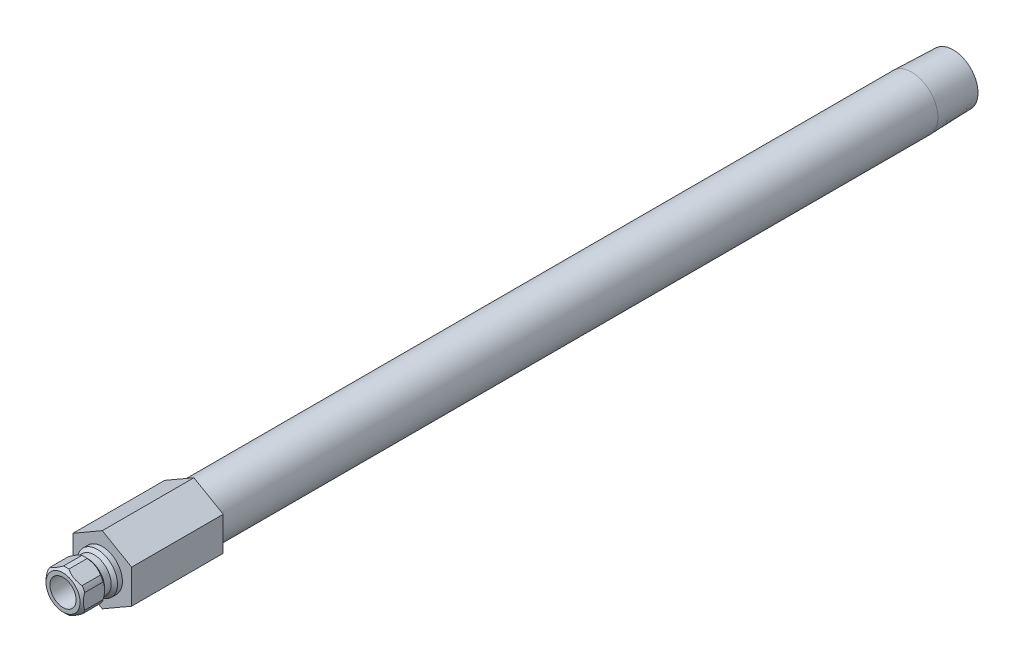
ISO-10303-21;
HEADER;
FILE_DESCRIPTION(('STEP AP214'),'2;1');
FILE_NAME('part.step','',(''),(''),'','','');
FILE_SCHEMA(('AUTOMOTIVE_DESIGN { 1 0 10303 214 1 1 1 1 }'));
ENDSEC;
DATA;
#1=APPLICATION_CONTEXT('core data for automotive mechanical design processes');
#2=APPLICATION_PROTOCOL_DEFINITION('international standard','automotive_design',2000,#1);
#3=PRODUCT_CONTEXT('',#1,'mechanical');
#4=PRODUCT('Part','Part','',(#3));
#5=PRODUCT_RELATED_PRODUCT_CATEGORY('part','',(#4));
#6=PRODUCT_DEFINITION_FORMATION('','',#4);
#7=PRODUCT_DEFINITION_CONTEXT('part definition',#1,'design');
#8=PRODUCT_DEFINITION('design','',#6,#7);
#9=PRODUCT_DEFINITION_SHAPE('','',#8);
#10=(LENGTH_UNIT() NAMED_UNIT(*) SI_UNIT(.MILLI.,.METRE.));
#11=(NAMED_UNIT(*) PLANE_ANGLE_UNIT() SI_UNIT($,.RADIAN.));
#12=(NAMED_UNIT(*) SI_UNIT($,.STERADIAN.) SOLID_ANGLE_UNIT());
#13=UNCERTAINTY_MEASURE_WITH_UNIT(LENGTH_MEASURE(1.E-05),#10,'distance_accuracy_value','');
#14=(GEOMETRIC_REPRESENTATION_CONTEXT(3) GLOBAL_UNCERTAINTY_ASSIGNED_CONTEXT((#13)) GLOBAL_UNIT_ASSIGNED_CONTEXT((#10,
#11,#12)) REPRESENTATION_CONTEXT('',''));
#15=CARTESIAN_POINT('',(0.,0.,0.));
#16=DIRECTION('',(0.,0.,1.));
#17=DIRECTION('',(1.,0.,0.));
#18=AXIS2_PLACEMENT_3D('',#15,#16,#17);
#19=CARTESIAN_POINT('',(0.,0.,0.));
#20=DIRECTION('',(0.,0.,-1.));
#21=DIRECTION('',(0.,1.,0.));
#22=AXIS2_PLACEMENT_3D('',#19,#20,#21);
#23=CYLINDRICAL_SURFACE('',#22,4.8895);
#24=DIRECTION('',(0.,0.,-1.));
#25=VECTOR('',#24,1.);
#26=CARTESIAN_POINT('',(3.87288738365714,-2.98461950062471,0.));
#27=LINE('',#26,#25);
#28=CARTESIAN_POINT('',(3.87288738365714,-2.98461950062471,4.318));
#29=VERTEX_POINT('',#28);
#30=CARTESIAN_POINT('',(3.87288738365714,-2.98461950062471,8.76299999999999));
#31=VERTEX_POINT('',#30);
#32=EDGE_CURVE('E392',#29,#31,#27,.F.);
#33=ORIENTED_EDGE('',*,*,#32,.F.);
#34=CARTESIAN_POINT('',(0.,0.,4.318));
#35=DIRECTION('',(0.,0.,-1.));
#36=DIRECTION('',(0.,1.,0.));
#37=AXIS2_PLACEMENT_3D('',#34,#35,#36);
#38=CIRCLE('',#37,4.8895);
#39=CARTESIAN_POINT('',(4.5212,-1.86170910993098,4.318));
#40=VERTEX_POINT('',#39);
#41=EDGE_CURVE('E369',#40,#29,#38,.T.);
#42=ORIENTED_EDGE('',*,*,#41,.F.);
#43=DIRECTION('',(0.,0.,-1.));
#44=VECTOR('',#43,1.);
#45=CARTESIAN_POINT('',(4.5212,-1.86170910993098,0.));
#46=LINE('',#45,#44);
#47=CARTESIAN_POINT('',(4.5212,-1.86170910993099,8.76299999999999));
#48=VERTEX_POINT('',#47);
#49=EDGE_CURVE('E383',#48,#40,#46,.T.);
#50=ORIENTED_EDGE('',*,*,#49,.F.);
#51=CARTESIAN_POINT('',(0.,0.,8.76299999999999));
#52=DIRECTION('',(0.,0.,-1.));
#53=DIRECTION('',(0.,1.,0.));
#54=AXIS2_PLACEMENT_3D('',#51,#52,#53);
#55=CIRCLE('',#54,4.8895);
#56=EDGE_CURVE('E191',#48,#31,#55,.T.);
#57=ORIENTED_EDGE('',*,*,#56,.T.);
#58=EDGE_LOOP('',(#33,#42,#50,#57));
#59=FACE_BOUND('',#58,.T.);
#60=ADVANCED_FACE('F34',(#59),#23,.T.);
#61=DIRECTION('',(0.,0.,-1.));
#62=VECTOR('',#61,1.);
#63=CARTESIAN_POINT('',(4.5212,1.86170910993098,0.));
#64=LINE('',#63,#62);
#65=CARTESIAN_POINT('',(4.5212,1.86170910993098,4.318));
#66=VERTEX_POINT('',#65);
#67=CARTESIAN_POINT('',(4.5212,1.86170910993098,8.76299999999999));
#68=VERTEX_POINT('',#67);
#69=EDGE_CURVE('E295',#66,#68,#64,.F.);
#70=ORIENTED_EDGE('',*,*,#69,.F.);
#71=CARTESIAN_POINT('',(3.87288738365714,2.98461950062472,4.318));
#72=VERTEX_POINT('',#71);
#73=EDGE_CURVE('E204',#72,#66,#38,.T.);
#74=ORIENTED_EDGE('',*,*,#73,.F.);
#75=DIRECTION('',(0.,0.,-1.));
#76=VECTOR('',#75,1.);
#77=CARTESIAN_POINT('',(3.87288738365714,2.98461950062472,0.));
#78=LINE('',#77,#76);
#79=CARTESIAN_POINT('',(3.87288738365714,2.98461950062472,8.76299999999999));
#80=VERTEX_POINT('',#79);
#81=EDGE_CURVE('E380',#80,#72,#78,.T.);
#82=ORIENTED_EDGE('',*,*,#81,.F.);
#83=EDGE_CURVE('E198',#80,#68,#55,.T.);
#84=ORIENTED_EDGE('',*,*,#83,.T.);
#85=EDGE_LOOP('',(#70,#74,#82,#84));
#86=FACE_BOUND('',#85,.T.);
#87=ADVANCED_FACE('F329',(#86),#23,.T.);
#88=DIRECTION('',(0.,0.,-1.));
#89=VECTOR('',#88,1.);
#90=CARTESIAN_POINT('',(0.648312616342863,4.84632861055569,0.));
#91=LINE('',#90,#89);
#92=CARTESIAN_POINT('',(0.648312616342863,4.84632861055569,4.318));
#93=VERTEX_POINT('',#92);
#94=CARTESIAN_POINT('',(0.648312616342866,4.84632861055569,8.76299999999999));
#95=VERTEX_POINT('',#94);
#96=EDGE_CURVE('E385',#93,#95,#91,.F.);
#97=ORIENTED_EDGE('',*,*,#96,.F.);
#98=CARTESIAN_POINT('',(-0.648312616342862,4.84632861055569,4.318));
#99=VERTEX_POINT('',#98);
#100=EDGE_CURVE('E200',#99,#93,#38,.T.);
#101=ORIENTED_EDGE('',*,*,#100,.F.);
#102=DIRECTION('',(0.,0.,-1.));
#103=VECTOR('',#102,1.);
#104=CARTESIAN_POINT('',(-0.648312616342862,4.84632861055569,0.));
#105=LINE('',#104,#103);
#106=CARTESIAN_POINT('',(-0.648312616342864,4.84632861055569,8.76299999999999));
#107=VERTEX_POINT('',#106);
#108=EDGE_CURVE('E361',#107,#99,#105,.T.);
#109=ORIENTED_EDGE('',*,*,#108,.F.);
#110=EDGE_CURVE('E193',#107,#95,#55,.T.);
#111=ORIENTED_EDGE('',*,*,#110,.T.);
#112=EDGE_LOOP('',(#97,#101,#109,#111));
#113=FACE_BOUND('',#112,.T.);
#114=ADVANCED_FACE('F334',(#113),#23,.T.);
#115=DIRECTION('',(0.,0.,-1.));
#116=VECTOR('',#115,1.);
#117=CARTESIAN_POINT('',(-3.87288738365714,2.98461950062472,0.));
#118=LINE('',#117,#116);
#119=CARTESIAN_POINT('',(-3.87288738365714,2.98461950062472,4.318));
#120=VERTEX_POINT('',#119);
#121=CARTESIAN_POINT('',(-3.87288738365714,2.98461950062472,8.76299999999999));
#122=VERTEX_POINT('',#121);
#123=EDGE_CURVE('E54',#120,#122,#118,.F.);
#124=ORIENTED_EDGE('',*,*,#123,.F.);
#125=CARTESIAN_POINT('',(-4.5212,1.86170910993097,4.318));
#126=VERTEX_POINT('',#125);
#127=EDGE_CURVE('E203',#126,#120,#38,.T.);
#128=ORIENTED_EDGE('',*,*,#127,.F.);
#129=DIRECTION('',(0.,0.,-1.));
#130=VECTOR('',#129,1.);
#131=CARTESIAN_POINT('',(-4.5212,1.86170910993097,0.));
#132=LINE('',#131,#130);
#133=CARTESIAN_POINT('',(-4.5212,1.86170910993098,8.763));
#134=VERTEX_POINT('',#133);
#135=EDGE_CURVE('E249',#134,#126,#132,.T.);
#136=ORIENTED_EDGE('',*,*,#135,.F.);
#137=EDGE_CURVE('E189',#134,#122,#55,.T.);
#138=ORIENTED_EDGE('',*,*,#137,.T.);
#139=EDGE_LOOP('',(#124,#128,#136,#138));
#140=FACE_BOUND('',#139,.T.);
#141=ADVANCED_FACE('F346',(#140),#23,.T.);
#142=DIRECTION('',(0.,0.,-1.));
#143=VECTOR('',#142,1.);
#144=CARTESIAN_POINT('',(-4.5212,-1.86170910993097,0.));
#145=LINE('',#144,#143);
#146=CARTESIAN_POINT('',(-4.5212,-1.86170910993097,4.318));
#147=VERTEX_POINT('',#146);
#148=CARTESIAN_POINT('',(-4.5212,-1.86170910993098,8.76299999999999));
#149=VERTEX_POINT('',#148);
#150=EDGE_CURVE('E62',#147,#149,#145,.F.);
#151=ORIENTED_EDGE('',*,*,#150,.F.);
#152=CARTESIAN_POINT('',(-3.87288738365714,-2.98461950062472,4.318));
#153=VERTEX_POINT('',#152);
#154=EDGE_CURVE('E182',#153,#147,#38,.T.);
#155=ORIENTED_EDGE('',*,*,#154,.F.);
#156=DIRECTION('',(0.,0.,-1.));
#157=VECTOR('',#156,1.);
#158=CARTESIAN_POINT('',(-3.87288738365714,-2.98461950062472,0.));
#159=LINE('',#158,#157);
#160=CARTESIAN_POINT('',(-3.87288738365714,-2.98461950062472,8.76299999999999));
#161=VERTEX_POINT('',#160);
#162=EDGE_CURVE('E165',#161,#153,#159,.T.);
#163=ORIENTED_EDGE('',*,*,#162,.F.);
#164=EDGE_CURVE('E180',#161,#149,#55,.T.);
#165=ORIENTED_EDGE('',*,*,#164,.T.);
#166=EDGE_LOOP('',(#151,#155,#163,#165));
#167=FACE_BOUND('',#166,.T.);
#168=ADVANCED_FACE('F179',(#167),#23,.T.);
#169=CARTESIAN_POINT('',(0.,0.,0.));
#170=DIRECTION('',(0.,0.,-1.));
#171=DIRECTION('',(0.,1.,0.));
#172=AXIS2_PLACEMENT_3D('',#169,#170,#171);
#173=CYLINDRICAL_SURFACE('',#172,6.34999999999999);
#174=CARTESIAN_POINT('',(0.,0.,-196.342));
#175=DIRECTION('',(0.,0.,-1.));
#176=DIRECTION('',(0.,1.,0.));
#177=AXIS2_PLACEMENT_3D('',#174,#175,#176);
#178=CIRCLE('',#177,6.34999999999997);
#179=CARTESIAN_POINT('',(0.,6.35,-196.342));
#180=VERTEX_POINT('',#179);
#181=EDGE_CURVE('E217',#180,#180,#178,.T.);
#182=ORIENTED_EDGE('',*,*,#181,.F.);
#183=EDGE_LOOP('',(#182));
#184=FACE_BOUND('',#183,.T.);
#185=CARTESIAN_POINT('',(0.,0.,-22.225));
#186=DIRECTION('',(0.,0.,1.));
#187=DIRECTION('',(1.,0.,0.));
#188=AXIS2_PLACEMENT_3D('',#185,#186,#187);
#189=CIRCLE('',#188,6.34999999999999);
#190=CARTESIAN_POINT('',(6.34999999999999,0.,-22.225));
#191=VERTEX_POINT('',#190);
#192=EDGE_CURVE('E438',#191,#191,#189,.F.);
#193=ORIENTED_EDGE('',*,*,#192,.T.);
#194=EDGE_LOOP('',(#193));
#195=FACE_BOUND('',#194,.T.);
#196=ADVANCED_FACE('F345',(#184,#195),#173,.T.);
#197=CARTESIAN_POINT('',(0.,6.03647060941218,-206.375));
#198=DIRECTION('',(0.,0.,-1.));
#199=DIRECTION('',(0.,1.,0.));
#200=AXIS2_PLACEMENT_3D('',#197,#198,#199);
#201=PLANE('',#200);
#202=CARTESIAN_POINT('',(0.,0.,-206.375));
#203=DIRECTION('',(0.,0.,-1.));
#204=DIRECTION('',(0.,1.,0.));
#205=AXIS2_PLACEMENT_3D('',#202,#203,#204);
#206=CIRCLE('',#205,6.03647060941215);
#207=CARTESIAN_POINT('',(0.,6.03647060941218,-206.375));
#208=VERTEX_POINT('',#207);
#209=EDGE_CURVE('E174',#208,#208,#206,.T.);
#210=ORIENTED_EDGE('',*,*,#209,.T.);
#211=EDGE_LOOP('',(#210));
#212=FACE_BOUND('',#211,.T.);
#213=CARTESIAN_POINT('',(0.,0.,-206.375));
#214=DIRECTION('',(0.,0.,-1.));
#215=DIRECTION('',(0.,1.,0.));
#216=AXIS2_PLACEMENT_3D('',#213,#214,#215);
#217=CIRCLE('',#216,4.62279999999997);
#218=CARTESIAN_POINT('',(0.,4.6228,-206.375));
#219=VERTEX_POINT('',#218);
#220=EDGE_CURVE('E450',#219,#219,#217,.T.);
#221=ORIENTED_EDGE('',*,*,#220,.F.);
#222=EDGE_LOOP('',(#221));
#223=FACE_BOUND('',#222,.T.);
#224=ADVANCED_FACE('F36',(#212,#223),#201,.T.);
#225=CARTESIAN_POINT('',(0.,0.,-206.375));
#226=DIRECTION('',(0.,0.,1.));
#227=DIRECTION('',(0.,-1.,0.));
#228=AXIS2_PLACEMENT_3D('',#225,#226,#227);
#229=CONICAL_SURFACE('',#228,6.03647060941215,0.0312396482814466);
#230=ORIENTED_EDGE('',*,*,#181,.T.);
#231=EDGE_LOOP('',(#230));
#232=FACE_BOUND('',#231,.T.);
#233=ORIENTED_EDGE('',*,*,#209,.F.);
#234=EDGE_LOOP('',(#233));
#235=FACE_BOUND('',#234,.T.);
#236=ADVANCED_FACE('F526',(#232,#235),#229,.T.);
#237=CARTESIAN_POINT('',(0.,4.8895,0.));
#238=DIRECTION('',(0.,0.,1.));
#239=DIRECTION('',(0.,-1.,0.));
#240=AXIS2_PLACEMENT_3D('',#237,#238,#239);
#241=PLANE('',#240);
#242=CARTESIAN_POINT('',(0.,0.,0.));
#243=DIRECTION('',(0.,0.,-1.));
#244=DIRECTION('',(0.,1.,0.));
#245=AXIS2_PLACEMENT_3D('',#242,#243,#244);
#246=CIRCLE('',#245,4.8895);
#247=CARTESIAN_POINT('',(0.,4.8895,0.));
#248=VERTEX_POINT('',#247);
#249=EDGE_CURVE('E214',#248,#248,#246,.T.);
#250=ORIENTED_EDGE('',*,*,#249,.T.);
#251=EDGE_LOOP('',(#250));
#252=FACE_BOUND('',#251,.T.);
#253=DIRECTION('',(-0.866025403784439,-0.5,0.));
#254=VECTOR('',#253,1.);
#255=CARTESIAN_POINT('',(0.,8.21223022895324,0.));
#256=LINE('',#255,#254);
#257=CARTESIAN_POINT('',(0.,8.21223022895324,0.));
#258=VERTEX_POINT('',#257);
#259=CARTESIAN_POINT('',(-7.112,4.10611511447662,0.));
#260=VERTEX_POINT('',#259);
#261=EDGE_CURVE('E395',#258,#260,#256,.T.);
#262=ORIENTED_EDGE('',*,*,#261,.T.);
#263=DIRECTION('',(0.,-1.,0.));
#264=VECTOR('',#263,1.);
#265=CARTESIAN_POINT('',(-7.112,4.10611511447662,0.));
#266=LINE('',#265,#264);
#267=CARTESIAN_POINT('',(-7.112,-4.10611511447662,0.));
#268=VERTEX_POINT('',#267);
#269=EDGE_CURVE('E422',#260,#268,#266,.T.);
#270=ORIENTED_EDGE('',*,*,#269,.T.);
#271=DIRECTION('',(0.866025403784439,-0.5,0.));
#272=VECTOR('',#271,1.);
#273=CARTESIAN_POINT('',(-7.112,-4.10611511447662,0.));
#274=LINE('',#273,#272);
#275=CARTESIAN_POINT('',(0.,-8.21223022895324,0.));
#276=VERTEX_POINT('',#275);
#277=EDGE_CURVE('E425',#268,#276,#274,.T.);
#278=ORIENTED_EDGE('',*,*,#277,.T.);
#279=DIRECTION('',(0.866025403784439,0.5,0.));
#280=VECTOR('',#279,1.);
#281=CARTESIAN_POINT('',(0.,-8.21223022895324,0.));
#282=LINE('',#281,#280);
#283=CARTESIAN_POINT('',(7.112,-4.10611511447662,0.));
#284=VERTEX_POINT('',#283);
#285=EDGE_CURVE('E428',#276,#284,#282,.T.);
#286=ORIENTED_EDGE('',*,*,#285,.T.);
#287=DIRECTION('',(0.,1.,0.));
#288=VECTOR('',#287,1.);
#289=CARTESIAN_POINT('',(7.112,-4.10611511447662,0.));
#290=LINE('',#289,#288);
#291=CARTESIAN_POINT('',(7.112,4.10611511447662,0.));
#292=VERTEX_POINT('',#291);
#293=EDGE_CURVE('E431',#284,#292,#290,.T.);
#294=ORIENTED_EDGE('',*,*,#293,.T.);
#295=DIRECTION('',(-0.866025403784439,0.5,0.));
#296=VECTOR('',#295,1.);
#297=CARTESIAN_POINT('',(7.112,4.10611511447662,0.));
#298=LINE('',#297,#296);
#299=EDGE_CURVE('E404',#292,#258,#298,.T.);
#300=ORIENTED_EDGE('',*,*,#299,.T.);
#301=EDGE_LOOP('',(#262,#270,#278,#286,#294,#300));
#302=FACE_BOUND('',#301,.T.);
#303=ADVANCED_FACE('F523',(#252,#302),#241,.T.);
#304=CARTESIAN_POINT('',(0.,0.,0.));
#305=DIRECTION('',(0.,0.,-1.));
#306=DIRECTION('',(0.,1.,0.));
#307=AXIS2_PLACEMENT_3D('',#304,#305,#306);
#308=CYLINDRICAL_SURFACE('',#307,4.8895);
#309=CARTESIAN_POINT('',(0.,0.,1.2065));
#310=DIRECTION('',(0.,0.,-1.));
#311=DIRECTION('',(0.,1.,0.));
#312=AXIS2_PLACEMENT_3D('',#309,#310,#311);
#313=CIRCLE('',#312,4.8895);
#314=CARTESIAN_POINT('',(0.,4.8895,1.2065));
#315=VERTEX_POINT('',#314);
#316=EDGE_CURVE('E211',#315,#315,#313,.T.);
#317=ORIENTED_EDGE('',*,*,#316,.T.);
#318=EDGE_LOOP('',(#317));
#319=FACE_BOUND('',#318,.T.);
#320=ORIENTED_EDGE('',*,*,#249,.F.);
#321=EDGE_LOOP('',(#320));
#322=FACE_BOUND('',#321,.T.);
#323=ADVANCED_FACE('F525',(#319,#322),#308,.T.);
#324=CARTESIAN_POINT('',(0.,0.,1.2065));
#325=DIRECTION('',(0.,0.,-1.));
#326=DIRECTION('',(0.,1.,0.));
#327=AXIS2_PLACEMENT_3D('',#324,#325,#326);
#328=CONICAL_SURFACE('',#327,4.8895,0.785398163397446);
#329=CARTESIAN_POINT('',(0.,0.,1.9685));
#330=DIRECTION('',(0.,0.,-1.));
#331=DIRECTION('',(0.,1.,0.));
#332=AXIS2_PLACEMENT_3D('',#329,#330,#331);
#333=CIRCLE('',#332,4.1275);
#334=CARTESIAN_POINT('',(0.,4.1275,1.9685));
#335=VERTEX_POINT('',#334);
#336=EDGE_CURVE('E208',#335,#335,#333,.T.);
#337=ORIENTED_EDGE('',*,*,#336,.T.);
#338=EDGE_LOOP('',(#337));
#339=FACE_BOUND('',#338,.T.);
#340=ORIENTED_EDGE('',*,*,#316,.F.);
#341=EDGE_LOOP('',(#340));
#342=FACE_BOUND('',#341,.T.);
#343=ADVANCED_FACE('F533',(#339,#342),#328,.T.);
#344=CARTESIAN_POINT('',(0.,0.,0.));
#345=DIRECTION('',(0.,0.,-1.));
#346=DIRECTION('',(0.,1.,0.));
#347=AXIS2_PLACEMENT_3D('',#344,#345,#346);
#348=CYLINDRICAL_SURFACE('',#347,4.1275);
#349=CARTESIAN_POINT('',(0.,0.,3.556));
#350=DIRECTION('',(0.,0.,-1.));
#351=DIRECTION('',(0.,1.,0.));
#352=AXIS2_PLACEMENT_3D('',#349,#350,#351);
#353=CIRCLE('',#352,4.1275);
#354=CARTESIAN_POINT('',(0.,4.1275,3.556));
#355=VERTEX_POINT('',#354);
#356=EDGE_CURVE('E205',#355,#355,#353,.T.);
#357=ORIENTED_EDGE('',*,*,#356,.T.);
#358=EDGE_LOOP('',(#357));
#359=FACE_BOUND('',#358,.T.);
#360=ORIENTED_EDGE('',*,*,#336,.F.);
#361=EDGE_LOOP('',(#360));
#362=FACE_BOUND('',#361,.T.);
#363=ADVANCED_FACE('F256',(#359,#362),#348,.T.);
#364=CARTESIAN_POINT('',(0.,0.,3.556));
#365=DIRECTION('',(0.,0.,1.));
#366=DIRECTION('',(0.,-1.,0.));
#367=AXIS2_PLACEMENT_3D('',#364,#365,#366);
#368=CONICAL_SURFACE('',#367,4.1275,0.785398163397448);
#369=CARTESIAN_POINT('',(0.64785777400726,-4.84659121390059,4.3182));
#370=CARTESIAN_POINT('',(0.775261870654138,-4.77303442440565,4.26213711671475));
#371=CARTESIAN_POINT('',(0.904457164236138,-4.69844348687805,4.21102627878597));
#372=CARTESIAN_POINT('',(1.16629518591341,-4.5472712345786,4.12074318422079));
#373=CARTESIAN_POINT('',(1.2989462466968,-4.47068510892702,4.08160338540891));
#374=CARTESIAN_POINT('',(1.56203676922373,-4.31878972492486,4.01877592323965));
#375=CARTESIAN_POINT('',(1.69238331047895,-4.24353411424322,3.99458163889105));
#376=CARTESIAN_POINT('',(1.95434729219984,-4.09228913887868,3.96102228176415));
#377=CARTESIAN_POINT('',(2.0859628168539,-4.01630088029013,3.951637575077));
#378=CARTESIAN_POINT('',(2.35623055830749,-3.86026172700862,3.9482192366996));
#379=CARTESIAN_POINT('',(2.49489129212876,-3.78020591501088,3.95501290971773));
#380=CARTESIAN_POINT('',(2.77103341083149,-3.62077518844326,3.98518499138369));
#381=CARTESIAN_POINT('',(2.90851272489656,-3.54140146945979,4.00858815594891));
#382=CARTESIAN_POINT('',(3.18622016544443,-3.38106700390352,4.07155129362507));
#383=CARTESIAN_POINT('',(3.32634361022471,-3.30016669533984,4.11171074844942));
#384=CARTESIAN_POINT('',(3.60275664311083,-3.14057955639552,4.20550294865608));
#385=CARTESIAN_POINT('',(3.73905611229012,-3.06188702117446,4.25909654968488));
#386=CARTESIAN_POINT('',(3.87334222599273,-2.98435689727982,4.3182));
#387=B_SPLINE_CURVE_WITH_KNOTS('',3,(#369,#370,#371,#372,#373,#374,#375,#376,#377,#378,#379,
#380,#381,#382,#383,#384,#385,#386),.UNSPECIFIED.,.F.,.F.,(4,2,2,2,2,2,2,2,4),(0.,
0.472469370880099,0.946208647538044,1.40285320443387,1.85889185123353,2.33874707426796,
2.81931901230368,3.31879975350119,3.81684169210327),.UNSPECIFIED.);
#388=CARTESIAN_POINT('',(0.648312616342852,-4.84632861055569,4.318));
#389=VERTEX_POINT('',#388);
#390=EDGE_CURVE('E394',#389,#29,#387,.T.);
#391=ORIENTED_EDGE('',*,*,#390,.F.);
#392=CARTESIAN_POINT('',(-0.648312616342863,-4.84632861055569,4.318));
#393=VERTEX_POINT('',#392);
#394=EDGE_CURVE('E367',#389,#393,#38,.T.);
#395=ORIENTED_EDGE('',*,*,#394,.T.);
#396=CARTESIAN_POINT('',(-3.87334222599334,-2.98435689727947,4.31820000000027));
#397=CARTESIAN_POINT('',(-3.74593812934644,-3.05791368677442,4.26213711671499));
#398=CARTESIAN_POINT('',(-3.61674283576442,-3.13250462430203,4.21102627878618));
#399=CARTESIAN_POINT('',(-3.35490481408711,-3.28367687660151,4.12074318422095));
#400=CARTESIAN_POINT('',(-3.22225375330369,-3.3602630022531,4.08160338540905));
#401=CARTESIAN_POINT('',(-2.95916323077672,-3.51215838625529,4.01877592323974));
#402=CARTESIAN_POINT('',(-2.82881668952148,-3.58741399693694,3.99458163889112));
#403=CARTESIAN_POINT('',(-2.56685270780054,-3.73865897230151,3.96102228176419));
#404=CARTESIAN_POINT('',(-2.43523718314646,-3.81464723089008,3.95163757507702));
#405=CARTESIAN_POINT('',(-2.16496944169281,-3.97068638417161,3.94821923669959));
#406=CARTESIAN_POINT('',(-2.02630870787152,-4.05074219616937,3.95501290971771));
#407=CARTESIAN_POINT('',(-1.75016658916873,-4.21017292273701,3.98518499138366));
#408=CARTESIAN_POINT('',(-1.61268727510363,-4.28954664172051,4.00858815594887));
#409=CARTESIAN_POINT('',(-1.33497983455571,-4.44988110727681,4.07155129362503));
#410=CARTESIAN_POINT('',(-1.1948563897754,-4.5307814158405,4.11171074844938));
#411=CARTESIAN_POINT('',(-0.918443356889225,-4.69036855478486,4.20550294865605));
#412=CARTESIAN_POINT('',(-0.782143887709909,-4.76906109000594,4.25909654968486));
#413=CARTESIAN_POINT('',(-0.647857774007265,-4.84659121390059,4.3182));
#414=B_SPLINE_CURVE_WITH_KNOTS('',3,(#396,#397,#398,#399,#400,#401,#402,#403,#404,#405,#406,
#407,#408,#409,#410,#411,#412,#413),.UNSPECIFIED.,.F.,.F.,(4,2,2,2,2,2,2,2,4),(0.,
0.472469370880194,0.946208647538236,1.40285320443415,1.85889185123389,2.33874707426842,
2.81931901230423,3.31879975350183,3.81684169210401),.UNSPECIFIED.);
#415=EDGE_CURVE('E242',#153,#393,#414,.T.);
#416=ORIENTED_EDGE('',*,*,#415,.F.);
#417=ORIENTED_EDGE('',*,*,#154,.T.);
#418=CARTESIAN_POINT('',(-4.5212,-5.15925306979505,6.2884665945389));
#419=CARTESIAN_POINT('',(-4.5212,-5.03341781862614,6.19384981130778));
#420=CARTESIAN_POINT('',(-4.5212,-4.90687282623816,6.10016148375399));
#421=CARTESIAN_POINT('',(-4.5212,-4.65208542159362,5.91505573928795));
#422=CARTESIAN_POINT('',(-4.5212,-4.52384258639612,5.82363890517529));
#423=CARTESIAN_POINT('',(-4.5212,-4.26444371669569,5.64284060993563));
#424=CARTESIAN_POINT('',(-4.5212,-4.13327280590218,5.55348041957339));
#425=CARTESIAN_POINT('',(-4.5212,-3.86869655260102,5.37814219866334));
#426=CARTESIAN_POINT('',(-4.5212,-3.735291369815,5.29216392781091));
#427=CARTESIAN_POINT('',(-4.5212,-3.45835736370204,5.1196421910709));
#428=CARTESIAN_POINT('',(-4.5212,-3.31467977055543,5.03333631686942));
#429=CARTESIAN_POINT('',(-4.5212,-3.02397608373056,4.86646929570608));
#430=CARTESIAN_POINT('',(-4.5212,-2.87694947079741,4.78590904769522));
#431=CARTESIAN_POINT('',(-4.5212,-2.57957206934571,4.6322757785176));
#432=CARTESIAN_POINT('',(-4.5212,-2.42923274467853,4.55918074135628));
#433=CARTESIAN_POINT('',(-4.5212,-2.12448469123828,4.4221138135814));
#434=CARTESIAN_POINT('',(-4.5212,-1.97007782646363,4.35813782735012));
#435=CARTESIAN_POINT('',(-4.5212,-1.66898205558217,4.24604782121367));
#436=CARTESIAN_POINT('',(-4.5212,-1.52260919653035,4.19709368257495));
#437=CARTESIAN_POINT('',(-4.5212,-1.22638031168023,4.11093488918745));
#438=CARTESIAN_POINT('',(-4.5212,-1.07652404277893,4.07373105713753));
#439=CARTESIAN_POINT('',(-4.5212,-0.776693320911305,4.01362130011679));
#440=CARTESIAN_POINT('',(-4.5212,-0.6267682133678,3.99047322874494));
#441=CARTESIAN_POINT('',(-4.5212,-0.32536672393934,3.95891692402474));
#442=CARTESIAN_POINT('',(-4.5212,-0.173890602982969,3.95050625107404));
#443=CARTESIAN_POINT('',(-4.5212,0.123852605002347,3.94903068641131));
#444=CARTESIAN_POINT('',(-4.5212,0.270117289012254,3.95544130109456));
#445=CARTESIAN_POINT('',(-4.5212,0.561370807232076,3.98210770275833));
#446=CARTESIAN_POINT('',(-4.5212,0.706359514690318,4.00236484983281));
#447=CARTESIAN_POINT('',(-4.5212,0.996462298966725,4.05597163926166));
#448=CARTESIAN_POINT('',(-4.5212,1.14153485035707,4.08954247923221));
#449=CARTESIAN_POINT('',(-4.5212,1.42852462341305,4.16800024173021));
#450=CARTESIAN_POINT('',(-4.5212,1.5704421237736,4.21288616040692));
#451=CARTESIAN_POINT('',(-4.5212,1.86505501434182,4.3171412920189));
#452=CARTESIAN_POINT('',(-4.5212,2.01739126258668,4.37751543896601));
#453=CARTESIAN_POINT('',(-4.5212,2.31809735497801,4.5075182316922));
#454=CARTESIAN_POINT('',(-4.5212,2.46646529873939,4.57715121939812));
#455=CARTESIAN_POINT('',(-4.5212,2.75996557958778,4.72401353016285));
#456=CARTESIAN_POINT('',(-4.5212,2.90508583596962,4.80126680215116));
#457=CARTESIAN_POINT('',(-4.5212,3.19198335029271,4.96166050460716));
#458=CARTESIAN_POINT('',(-4.5212,3.33376113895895,5.04479999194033));
#459=CARTESIAN_POINT('',(-4.5212,3.6074215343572,5.21154136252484));
#460=CARTESIAN_POINT('',(-4.5212,3.73944496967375,5.29491333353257));
#461=CARTESIAN_POINT('',(-4.5212,4.00122581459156,5.46515273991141));
#462=CARTESIAN_POINT('',(-4.5212,4.13098305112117,5.55202044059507));
#463=CARTESIAN_POINT('',(-4.5212,4.38747396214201,5.7279062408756));
#464=CARTESIAN_POINT('',(-4.5212,4.51422365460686,5.81690106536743));
#465=CARTESIAN_POINT('',(-4.5212,4.76599253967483,5.99723636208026));
#466=CARTESIAN_POINT('',(-4.5212,4.89101219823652,6.08857618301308));
#467=CARTESIAN_POINT('',(-4.5212,5.01530771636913,6.18087446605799));
#468=B_SPLINE_CURVE_WITH_KNOTS('',3,(#418,#419,#420,#421,#422,#423,#424,#425,#426,#427,#428,
#429,#430,#431,#432,#433,#434,#435,#436,#437,#438,#439,#440,#441,#442,#443,#444,#445,#446,#447,
#448,#449,#450,#451,#452,#453,#454,#455,#456,#457,#458,#459,#460,#461,#462,#463,#464,#465,#466,
#467),.UNSPECIFIED.,.F.,.F.,(4,2,2,2,2,2,2,2,2,2,2,2,2,2,2,2,2,2,2,2,2,2,2,2,4),(0.,
0.472324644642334,0.944769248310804,1.42087610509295,1.89694907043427,2.39966187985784,
2.90245317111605,3.40371602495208,3.90475303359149,4.36737130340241,4.8300219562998,
5.28445770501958,5.73881822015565,6.17734710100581,6.61591906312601,7.06210522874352,
7.50825182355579,7.99945943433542,8.49089821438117,8.98393391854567,9.4768908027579,
9.94525924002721,10.4136632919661,10.8782525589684,11.3427141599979),.UNSPECIFIED.);
#469=EDGE_CURVE('E265',#126,#147,#468,.F.);
#470=ORIENTED_EDGE('',*,*,#469,.F.);
#471=ORIENTED_EDGE('',*,*,#127,.T.);
#472=CARTESIAN_POINT('',(-0.647857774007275,4.84659121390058,4.3182));
#473=CARTESIAN_POINT('',(-0.775261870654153,4.77303442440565,4.26213711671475));
#474=CARTESIAN_POINT('',(-0.904457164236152,4.69844348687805,4.21102627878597));
#475=CARTESIAN_POINT('',(-1.16629518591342,4.5472712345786,4.12074318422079));
#476=CARTESIAN_POINT('',(-1.29894624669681,4.47068510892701,4.08160338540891));
#477=CARTESIAN_POINT('',(-1.56203676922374,4.31878972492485,4.01877592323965));
#478=CARTESIAN_POINT('',(-1.69238331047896,4.24353411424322,3.99458163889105));
#479=CARTESIAN_POINT('',(-1.95434729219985,4.09228913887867,3.96102228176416));
#480=CARTESIAN_POINT('',(-2.0859628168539,4.01630088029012,3.95163757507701));
#481=CARTESIAN_POINT('',(-2.35623055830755,3.86026172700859,3.94821923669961));
#482=CARTESIAN_POINT('',(-2.49489129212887,3.78020591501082,3.95501290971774));
#483=CARTESIAN_POINT('',(-2.7710334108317,3.62077518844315,3.98518499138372));
#484=CARTESIAN_POINT('',(-2.90851272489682,3.54140146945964,4.00858815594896));
#485=CARTESIAN_POINT('',(-3.18622016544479,3.38106700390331,4.07155129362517));
#486=CARTESIAN_POINT('',(-3.32634361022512,3.30016669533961,4.11171074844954));
#487=CARTESIAN_POINT('',(-3.60275664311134,3.14057955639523,4.20550294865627));
#488=CARTESIAN_POINT('',(-3.73905611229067,3.06188702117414,4.2590965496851));
#489=CARTESIAN_POINT('',(-3.87334222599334,2.98435689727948,4.31820000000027));
#490=B_SPLINE_CURVE_WITH_KNOTS('',3,(#472,#473,#474,#475,#476,#477,#478,#479,#480,#481,#482,
#483,#484,#485,#486,#487,#488,#489),.UNSPECIFIED.,.F.,.F.,(4,2,2,2,2,2,2,2,4),(0.,
0.472469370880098,0.946208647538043,1.40285320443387,1.85889185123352,2.33874707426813,
2.81931901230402,3.31879975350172,3.81684169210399),.UNSPECIFIED.);
#491=EDGE_CURVE('E272',#99,#120,#490,.T.);
#492=ORIENTED_EDGE('',*,*,#491,.F.);
#493=ORIENTED_EDGE('',*,*,#100,.T.);
#494=CARTESIAN_POINT('',(3.87334222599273,2.98435689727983,4.3182));
#495=CARTESIAN_POINT('',(3.74593812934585,3.05791368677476,4.26213711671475));
#496=CARTESIAN_POINT('',(3.61674283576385,3.13250462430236,4.21102627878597));
#497=CARTESIAN_POINT('',(3.35490481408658,3.28367687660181,4.12074318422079));
#498=CARTESIAN_POINT('',(3.22225375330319,3.36026300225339,4.08160338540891));
#499=CARTESIAN_POINT('',(2.95916323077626,3.51215838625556,4.01877592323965));
#500=CARTESIAN_POINT('',(2.82881668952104,3.58741399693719,3.99458163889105));
#501=CARTESIAN_POINT('',(2.56685270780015,3.73865897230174,3.96102228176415));
#502=CARTESIAN_POINT('',(2.4352371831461,3.81464723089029,3.95163757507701));
#503=CARTESIAN_POINT('',(2.16496944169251,3.97068638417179,3.94821923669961));
#504=CARTESIAN_POINT('',(2.02630870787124,4.05074219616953,3.95501290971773));
#505=CARTESIAN_POINT('',(1.75016658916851,4.21017292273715,3.98518499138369));
#506=CARTESIAN_POINT('',(1.61268727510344,4.28954664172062,4.00858815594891));
#507=CARTESIAN_POINT('',(1.33497983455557,4.44988110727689,4.07155129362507));
#508=CARTESIAN_POINT('',(1.19485638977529,4.53078141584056,4.11171074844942));
#509=CARTESIAN_POINT('',(0.918443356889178,4.69036855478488,4.20550294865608));
#510=CARTESIAN_POINT('',(0.78214388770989,4.76906109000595,4.25909654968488));
#511=CARTESIAN_POINT('',(0.647857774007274,4.84659121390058,4.3182));
#512=B_SPLINE_CURVE_WITH_KNOTS('',3,(#494,#495,#496,#497,#498,#499,#500,#501,#502,#503,#504,
#505,#506,#507,#508,#509,#510,#511),.UNSPECIFIED.,.F.,.F.,(4,2,2,2,2,2,2,2,4),(0.,
0.472469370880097,0.946208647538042,1.40285320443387,1.85889185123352,2.33874707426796,
2.81931901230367,3.31879975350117,3.81684169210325),.UNSPECIFIED.);
#513=EDGE_CURVE('E279',#72,#93,#512,.T.);
#514=ORIENTED_EDGE('',*,*,#513,.F.);
#515=ORIENTED_EDGE('',*,*,#73,.T.);
#516=CARTESIAN_POINT('',(4.5212,-5.15925306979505,6.2884665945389));
#517=CARTESIAN_POINT('',(4.5212,-5.03341781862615,6.19384981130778));
#518=CARTESIAN_POINT('',(4.5212,-4.90687282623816,6.10016148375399));
#519=CARTESIAN_POINT('',(4.5212,-4.65208542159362,5.91505573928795));
#520=CARTESIAN_POINT('',(4.5212,-4.52384258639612,5.82363890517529));
#521=CARTESIAN_POINT('',(4.5212,-4.26444371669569,5.64284060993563));
#522=CARTESIAN_POINT('',(4.5212,-4.13327280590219,5.55348041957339));
#523=CARTESIAN_POINT('',(4.5212,-3.86869655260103,5.37814219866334));
#524=CARTESIAN_POINT('',(4.5212,-3.735291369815,5.29216392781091));
#525=CARTESIAN_POINT('',(4.5212,-3.45835736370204,5.1196421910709));
#526=CARTESIAN_POINT('',(4.5212,-3.31467977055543,5.03333631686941));
#527=CARTESIAN_POINT('',(4.5212,-3.02397608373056,4.86646929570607));
#528=CARTESIAN_POINT('',(4.5212,-2.87694947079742,4.78590904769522));
#529=CARTESIAN_POINT('',(4.5212,-2.57957206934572,4.6322757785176));
#530=CARTESIAN_POINT('',(4.5212,-2.42923274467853,4.55918074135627));
#531=CARTESIAN_POINT('',(4.5212,-2.12448469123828,4.4221138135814));
#532=CARTESIAN_POINT('',(4.5212,-1.97007782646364,4.35813782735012));
#533=CARTESIAN_POINT('',(4.5212,-1.66898205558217,4.24604782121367));
#534=CARTESIAN_POINT('',(4.5212,-1.52260919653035,4.19709368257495));
#535=CARTESIAN_POINT('',(4.5212,-1.22638031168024,4.11093488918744));
#536=CARTESIAN_POINT('',(4.5212,-1.07652404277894,4.07373105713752));
#537=CARTESIAN_POINT('',(4.5212,-0.776693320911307,4.01362130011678));
#538=CARTESIAN_POINT('',(4.5212,-0.626768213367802,3.99047322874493));
#539=CARTESIAN_POINT('',(4.5212,-0.325366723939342,3.95891692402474));
#540=CARTESIAN_POINT('',(4.5212,-0.173890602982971,3.95050625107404));
#541=CARTESIAN_POINT('',(4.5212,0.123852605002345,3.94903068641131));
#542=CARTESIAN_POINT('',(4.5212,0.270117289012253,3.95544130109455));
#543=CARTESIAN_POINT('',(4.5212,0.561370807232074,3.98210770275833));
#544=CARTESIAN_POINT('',(4.5212,0.706359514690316,4.0023648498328));
#545=CARTESIAN_POINT('',(4.5212,0.996462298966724,4.05597163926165));
#546=CARTESIAN_POINT('',(4.5212,1.14153485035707,4.08954247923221));
#547=CARTESIAN_POINT('',(4.5212,1.42852462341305,4.16800024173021));
#548=CARTESIAN_POINT('',(4.5212,1.5704421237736,4.21288616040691));
#549=CARTESIAN_POINT('',(4.5212,1.86505501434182,4.3171412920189));
#550=CARTESIAN_POINT('',(4.5212,2.01739126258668,4.37751543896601));
#551=CARTESIAN_POINT('',(4.5212,2.31809735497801,4.5075182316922));
#552=CARTESIAN_POINT('',(4.5212,2.46646529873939,4.57715121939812));
#553=CARTESIAN_POINT('',(4.5212,2.75996557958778,4.72401353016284));
#554=CARTESIAN_POINT('',(4.5212,2.90508583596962,4.80126680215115));
#555=CARTESIAN_POINT('',(4.5212,3.19198335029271,4.96166050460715));
#556=CARTESIAN_POINT('',(4.5212,3.33376113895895,5.04479999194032));
#557=CARTESIAN_POINT('',(4.5212,3.6074215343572,5.21154136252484));
#558=CARTESIAN_POINT('',(4.5212,3.73944496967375,5.29491333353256));
#559=CARTESIAN_POINT('',(4.5212,4.00122581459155,5.4651527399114));
#560=CARTESIAN_POINT('',(4.5212,4.13098305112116,5.55202044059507));
#561=CARTESIAN_POINT('',(4.5212,4.38747396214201,5.72790624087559));
#562=CARTESIAN_POINT('',(4.5212,4.51422365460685,5.81690106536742));
#563=CARTESIAN_POINT('',(4.5212,4.76599253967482,5.99723636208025));
#564=CARTESIAN_POINT('',(4.5212,4.89101219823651,6.08857618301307));
#565=CARTESIAN_POINT('',(4.5212,5.01530771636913,6.18087446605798));
#566=B_SPLINE_CURVE_WITH_KNOTS('',3,(#516,#517,#518,#519,#520,#521,#522,#523,#524,#525,#526,
#527,#528,#529,#530,#531,#532,#533,#534,#535,#536,#537,#538,#539,#540,#541,#542,#543,#544,#545,
#546,#547,#548,#549,#550,#551,#552,#553,#554,#555,#556,#557,#558,#559,#560,#561,#562,#563,#564,
#565),.UNSPECIFIED.,.F.,.F.,(4,2,2,2,2,2,2,2,2,2,2,2,2,2,2,2,2,2,2,2,2,2,2,2,4),(0.,
0.472324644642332,0.944769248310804,1.42087610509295,1.89694907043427,2.39966187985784,
2.90245317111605,3.40371602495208,3.90475303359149,4.36737130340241,4.8300219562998,
5.28445770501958,5.73881822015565,6.17734710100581,6.61591906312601,7.06210522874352,
7.50825182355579,7.99945943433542,8.49089821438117,8.98393391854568,9.47689080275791,
9.94525924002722,10.4136632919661,10.8782525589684,11.3427141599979),.UNSPECIFIED.);
#567=EDGE_CURVE('E287',#40,#66,#566,.T.);
#568=ORIENTED_EDGE('',*,*,#567,.F.);
#569=ORIENTED_EDGE('',*,*,#41,.T.);
#570=EDGE_LOOP('',(#391,#395,#416,#417,#470,#471,#492,#493,#514,#515,#568,#569));
#571=FACE_BOUND('',#570,.T.);
#572=ORIENTED_EDGE('',*,*,#356,.F.);
#573=EDGE_LOOP('',(#572));
#574=FACE_BOUND('',#573,.T.);
#575=ADVANCED_FACE('F251',(#571,#574),#368,.T.);
#576=DIRECTION('',(0.,0.,-1.));
#577=VECTOR('',#576,1.);
#578=CARTESIAN_POINT('',(0.648312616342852,-4.84632861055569,0.));
#579=LINE('',#578,#577);
#580=CARTESIAN_POINT('',(0.648312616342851,-4.84632861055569,8.76299999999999));
#581=VERTEX_POINT('',#580);
#582=EDGE_CURVE('E294',#581,#389,#579,.T.);
#583=ORIENTED_EDGE('',*,*,#582,.F.);
#584=CARTESIAN_POINT('',(-0.648312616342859,-4.84632861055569,8.76299999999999));
#585=VERTEX_POINT('',#584);
#586=EDGE_CURVE('E188',#581,#585,#55,.T.);
#587=ORIENTED_EDGE('',*,*,#586,.T.);
#588=DIRECTION('',(0.,0.,-1.));
#589=VECTOR('',#588,1.);
#590=CARTESIAN_POINT('',(-0.648312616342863,-4.84632861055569,0.));
#591=LINE('',#590,#589);
#592=EDGE_CURVE('E168',#393,#585,#591,.F.);
#593=ORIENTED_EDGE('',*,*,#592,.F.);
#594=ORIENTED_EDGE('',*,*,#394,.F.);
#595=EDGE_LOOP('',(#583,#587,#593,#594));
#596=FACE_BOUND('',#595,.T.);
#597=ADVANCED_FACE('F255',(#596),#23,.T.);
#598=CARTESIAN_POINT('',(0.,0.,8.76299999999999));
#599=DIRECTION('',(0.,0.,-1.));
#600=DIRECTION('',(0.,1.,0.));
#601=AXIS2_PLACEMENT_3D('',#598,#599,#600);
#602=CONICAL_SURFACE('',#601,4.8895,0.785398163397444);
#603=CARTESIAN_POINT('',(3.87334222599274,-2.98435689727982,8.7628));
#604=CARTESIAN_POINT('',(3.74593812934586,-3.05791368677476,8.81886288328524));
#605=CARTESIAN_POINT('',(3.61674283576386,-3.13250462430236,8.86997372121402));
#606=CARTESIAN_POINT('',(3.35490481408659,-3.28367687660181,8.9602568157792));
#607=CARTESIAN_POINT('',(3.2222537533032,-3.36026300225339,8.99939661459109));
#608=CARTESIAN_POINT('',(2.95916323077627,-3.51215838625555,9.06222407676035));
#609=CARTESIAN_POINT('',(2.82881668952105,-3.58741399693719,9.08641836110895));
#610=CARTESIAN_POINT('',(2.56685270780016,-3.73865897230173,9.11997771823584));
#611=CARTESIAN_POINT('',(2.43523718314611,-3.81464723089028,9.12936242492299));
#612=CARTESIAN_POINT('',(2.16496944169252,-3.97068638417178,9.1327807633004));
#613=CARTESIAN_POINT('',(2.02630870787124,-4.05074219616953,9.12598709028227));
#614=CARTESIAN_POINT('',(1.75016658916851,-4.21017292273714,9.09581500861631));
#615=CARTESIAN_POINT('',(1.61268727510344,-4.28954664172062,9.07241184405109));
#616=CARTESIAN_POINT('',(1.33497983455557,-4.44988110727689,9.00944870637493));
#617=CARTESIAN_POINT('',(1.19485638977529,-4.53078141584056,8.96928925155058));
#618=CARTESIAN_POINT('',(0.91844335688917,-4.69036855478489,8.87549705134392));
#619=CARTESIAN_POINT('',(0.782143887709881,-4.76906109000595,8.82190345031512));
#620=CARTESIAN_POINT('',(0.647857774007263,-4.84659121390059,8.7628));
#621=B_SPLINE_CURVE_WITH_KNOTS('',3,(#603,#604,#605,#606,#607,#608,#609,#610,#611,#612,#613,
#614,#615,#616,#617,#618,#619,#620),.UNSPECIFIED.,.F.,.F.,(4,2,2,2,2,2,2,2,4),(0.,
0.472469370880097,0.946208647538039,1.40285320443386,1.85889185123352,2.33874707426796,
2.81931901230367,3.31879975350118,3.81684169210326),.UNSPECIFIED.);
#622=EDGE_CURVE('E12',#31,#581,#621,.T.);
#623=ORIENTED_EDGE('',*,*,#622,.F.);
#624=ORIENTED_EDGE('',*,*,#56,.F.);
#625=CARTESIAN_POINT('',(4.5212,-5.15925306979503,6.79253340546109));
#626=CARTESIAN_POINT('',(4.5212,-5.03341781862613,6.88715018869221));
#627=CARTESIAN_POINT('',(4.5212,-4.90687282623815,6.98083851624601));
#628=CARTESIAN_POINT('',(4.5212,-4.65208542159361,7.16594426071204));
#629=CARTESIAN_POINT('',(4.5212,-4.52384258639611,7.25736109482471));
#630=CARTESIAN_POINT('',(4.5212,-4.26444371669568,7.43815939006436));
#631=CARTESIAN_POINT('',(4.5212,-4.13327280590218,7.52751958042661));
#632=CARTESIAN_POINT('',(4.5212,-3.86869655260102,7.70285780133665));
#633=CARTESIAN_POINT('',(4.5212,-3.73529136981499,7.78883607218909));
#634=CARTESIAN_POINT('',(4.5212,-3.45835736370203,7.96135780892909));
#635=CARTESIAN_POINT('',(4.5212,-3.31467977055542,8.04766368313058));
#636=CARTESIAN_POINT('',(4.5212,-3.02397608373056,8.21453070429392));
#637=CARTESIAN_POINT('',(4.5212,-2.87694947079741,8.29509095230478));
#638=CARTESIAN_POINT('',(4.5212,-2.57957206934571,8.4487242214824));
#639=CARTESIAN_POINT('',(4.5212,-2.42923274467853,8.52181925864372));
#640=CARTESIAN_POINT('',(4.5212,-2.12448469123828,8.65888618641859));
#641=CARTESIAN_POINT('',(4.5212,-1.97007782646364,8.72286217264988));
#642=CARTESIAN_POINT('',(4.5212,-1.66898205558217,8.83495217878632));
#643=CARTESIAN_POINT('',(4.5212,-1.52260919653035,8.88390631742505));
#644=CARTESIAN_POINT('',(4.5212,-1.22638031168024,8.97006511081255));
#645=CARTESIAN_POINT('',(4.5212,-1.07652404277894,9.00726894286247));
#646=CARTESIAN_POINT('',(4.5212,-0.776693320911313,9.06737869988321));
#647=CARTESIAN_POINT('',(4.5212,-0.626768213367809,9.09052677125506));
#648=CARTESIAN_POINT('',(4.5212,-0.325366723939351,9.12208307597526));
#649=CARTESIAN_POINT('',(4.5212,-0.173890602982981,9.13049374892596));
#650=CARTESIAN_POINT('',(4.5212,0.123852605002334,9.13196931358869));
#651=CARTESIAN_POINT('',(4.5212,0.270117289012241,9.12555869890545));
#652=CARTESIAN_POINT('',(4.5212,0.561370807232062,9.09889229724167));
#653=CARTESIAN_POINT('',(4.5212,0.706359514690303,9.0786351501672));
#654=CARTESIAN_POINT('',(4.5212,0.99646229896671,9.02502836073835));
#655=CARTESIAN_POINT('',(4.5212,1.14153485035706,8.99145752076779));
#656=CARTESIAN_POINT('',(4.5212,1.42852462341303,8.91299975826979));
#657=CARTESIAN_POINT('',(4.5212,1.57044212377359,8.86811383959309));
#658=CARTESIAN_POINT('',(4.5212,1.8650550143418,8.76385870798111));
#659=CARTESIAN_POINT('',(4.5212,2.01739126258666,8.703484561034));
#660=CARTESIAN_POINT('',(4.5212,2.31809735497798,8.57348176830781));
#661=CARTESIAN_POINT('',(4.5212,2.46646529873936,8.50384878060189));
#662=CARTESIAN_POINT('',(4.5212,2.75996557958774,8.35698646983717));
#663=CARTESIAN_POINT('',(4.5212,2.90508583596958,8.27973319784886));
#664=CARTESIAN_POINT('',(4.5212,3.19198335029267,8.11933949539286));
#665=CARTESIAN_POINT('',(4.5212,3.3337611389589,8.0362000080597));
#666=CARTESIAN_POINT('',(4.5212,3.60742153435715,7.86945863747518));
#667=CARTESIAN_POINT('',(4.5212,3.7394449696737,7.78608666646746));
#668=CARTESIAN_POINT('',(4.5212,4.0012258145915,7.61584726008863));
#669=CARTESIAN_POINT('',(4.5212,4.1309830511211,7.52897955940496));
#670=CARTESIAN_POINT('',(4.5212,4.38747396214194,7.35309375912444));
#671=CARTESIAN_POINT('',(4.5212,4.51422365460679,7.26409893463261));
#672=CARTESIAN_POINT('',(4.5212,4.76599253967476,7.08376363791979));
#673=CARTESIAN_POINT('',(4.5212,4.89101219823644,6.99242381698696));
#674=CARTESIAN_POINT('',(4.5212,5.01530771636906,6.90012553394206));
#675=B_SPLINE_CURVE_WITH_KNOTS('',3,(#625,#626,#627,#628,#629,#630,#631,#632,#633,#634,#635,
#636,#637,#638,#639,#640,#641,#642,#643,#644,#645,#646,#647,#648,#649,#650,#651,#652,#653,#654,
#655,#656,#657,#658,#659,#660,#661,#662,#663,#664,#665,#666,#667,#668,#669,#670,#671,#672,#673,
#674),.UNSPECIFIED.,.F.,.F.,(4,2,2,2,2,2,2,2,2,2,2,2,2,2,2,2,2,2,2,2,2,2,2,2,4),(0.,
0.472324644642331,0.944769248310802,1.42087610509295,1.89694907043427,2.39966187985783,
2.90245317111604,3.40371602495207,3.90475303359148,4.3673713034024,4.83002195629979,
5.28445770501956,5.73881822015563,6.17734710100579,6.61591906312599,7.06210522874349,
7.50825182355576,7.99945943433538,8.49089821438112,8.98393391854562,9.47689080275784,
9.94525924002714,10.413663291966,10.8782525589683,11.3427141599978),.UNSPECIFIED.);
#676=EDGE_CURVE('E47',#68,#48,#675,.F.);
#677=ORIENTED_EDGE('',*,*,#676,.F.);
#678=ORIENTED_EDGE('',*,*,#83,.F.);
#679=CARTESIAN_POINT('',(0.64785777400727,4.84659121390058,8.7628));
#680=CARTESIAN_POINT('',(0.775261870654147,4.77303442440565,8.81886288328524));
#681=CARTESIAN_POINT('',(0.904457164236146,4.69844348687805,8.86997372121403));
#682=CARTESIAN_POINT('',(1.16629518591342,4.5472712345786,8.9602568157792));
#683=CARTESIAN_POINT('',(1.29894624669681,4.47068510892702,8.99939661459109));
#684=CARTESIAN_POINT('',(1.56203676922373,4.31878972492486,9.06222407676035));
#685=CARTESIAN_POINT('',(1.69238331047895,4.24353411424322,9.08641836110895));
#686=CARTESIAN_POINT('',(1.95434729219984,4.09228913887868,9.11997771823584));
#687=CARTESIAN_POINT('',(2.08596281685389,4.01630088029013,9.12936242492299));
#688=CARTESIAN_POINT('',(2.35623055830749,3.86026172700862,9.13278076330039));
#689=CARTESIAN_POINT('',(2.49489129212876,3.78020591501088,9.12598709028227));
#690=CARTESIAN_POINT('',(2.77103341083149,3.62077518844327,9.09581500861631));
#691=CARTESIAN_POINT('',(2.90851272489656,3.54140146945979,9.07241184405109));
#692=CARTESIAN_POINT('',(3.18622016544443,3.38106700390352,9.00944870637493));
#693=CARTESIAN_POINT('',(3.32634361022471,3.30016669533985,8.96928925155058));
#694=CARTESIAN_POINT('',(3.60275664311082,3.14057955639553,8.87549705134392));
#695=CARTESIAN_POINT('',(3.73905611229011,3.06188702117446,8.82190345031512));
#696=CARTESIAN_POINT('',(3.87334222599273,2.98435689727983,8.7628));
#697=B_SPLINE_CURVE_WITH_KNOTS('',3,(#679,#680,#681,#682,#683,#684,#685,#686,#687,#688,#689,
#690,#691,#692,#693,#694,#695,#696),.UNSPECIFIED.,.F.,.F.,(4,2,2,2,2,2,2,2,4),(0.,
0.472469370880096,0.946208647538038,1.40285320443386,1.85889185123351,2.33874707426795,
2.81931901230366,3.31879975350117,3.81684169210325),.UNSPECIFIED.);
#698=EDGE_CURVE('E311',#95,#80,#697,.T.);
#699=ORIENTED_EDGE('',*,*,#698,.F.);
#700=ORIENTED_EDGE('',*,*,#110,.F.);
#701=CARTESIAN_POINT('',(-3.87334222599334,2.98435689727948,8.76279999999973));
#702=CARTESIAN_POINT('',(-3.74593812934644,3.05791368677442,8.818862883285));
#703=CARTESIAN_POINT('',(-3.61674283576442,3.13250462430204,8.86997372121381));
#704=CARTESIAN_POINT('',(-3.35490481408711,3.28367687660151,8.96025681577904));
#705=CARTESIAN_POINT('',(-3.2222537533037,3.3602630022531,8.99939661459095));
#706=CARTESIAN_POINT('',(-2.95916323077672,3.51215838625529,9.06222407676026));
#707=CARTESIAN_POINT('',(-2.82881668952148,3.58741399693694,9.08641836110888));
#708=CARTESIAN_POINT('',(-2.56685270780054,3.73865897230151,9.11997771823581));
#709=CARTESIAN_POINT('',(-2.43523718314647,3.81464723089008,9.12936242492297));
#710=CARTESIAN_POINT('',(-2.16496944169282,3.97068638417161,9.1327807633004));
#711=CARTESIAN_POINT('',(-2.02630870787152,4.05074219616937,9.12598709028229));
#712=CARTESIAN_POINT('',(-1.75016658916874,4.21017292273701,9.09581500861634));
#713=CARTESIAN_POINT('',(-1.61268727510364,4.2895466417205,9.07241184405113));
#714=CARTESIAN_POINT('',(-1.33497983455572,4.44988110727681,9.00944870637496));
#715=CARTESIAN_POINT('',(-1.19485638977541,4.5307814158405,8.96928925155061));
#716=CARTESIAN_POINT('',(-0.918443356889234,4.69036855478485,8.87549705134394));
#717=CARTESIAN_POINT('',(-0.782143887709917,4.76906109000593,8.82190345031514));
#718=CARTESIAN_POINT('',(-0.647857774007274,4.84659121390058,8.7628));
#719=B_SPLINE_CURVE_WITH_KNOTS('',3,(#701,#702,#703,#704,#705,#706,#707,#708,#709,#710,#711,
#712,#713,#714,#715,#716,#717,#718),.UNSPECIFIED.,.F.,.F.,(4,2,2,2,2,2,2,2,4),(0.,
0.47246937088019,0.946208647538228,1.40285320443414,1.85889185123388,2.3387470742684,
2.81931901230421,3.31879975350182,3.816841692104),.UNSPECIFIED.);
#720=EDGE_CURVE('E315',#122,#107,#719,.T.);
#721=ORIENTED_EDGE('',*,*,#720,.F.);
#722=ORIENTED_EDGE('',*,*,#137,.F.);
#723=CARTESIAN_POINT('',(-4.5212,-5.15925306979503,6.79253340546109));
#724=CARTESIAN_POINT('',(-4.5212,-5.03341781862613,6.88715018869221));
#725=CARTESIAN_POINT('',(-4.5212,-4.90687282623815,6.98083851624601));
#726=CARTESIAN_POINT('',(-4.5212,-4.6520854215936,7.16594426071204));
#727=CARTESIAN_POINT('',(-4.5212,-4.5238425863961,7.25736109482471));
#728=CARTESIAN_POINT('',(-4.5212,-4.26444371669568,7.43815939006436));
#729=CARTESIAN_POINT('',(-4.5212,-4.13327280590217,7.52751958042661));
#730=CARTESIAN_POINT('',(-4.5212,-3.86869655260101,7.70285780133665));
#731=CARTESIAN_POINT('',(-4.5212,-3.73529136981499,7.78883607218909));
#732=CARTESIAN_POINT('',(-4.5212,-3.45835736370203,7.96135780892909));
#733=CARTESIAN_POINT('',(-4.5212,-3.31467977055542,8.04766368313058));
#734=CARTESIAN_POINT('',(-4.5212,-3.02397608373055,8.21453070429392));
#735=CARTESIAN_POINT('',(-4.5212,-2.87694947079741,8.29509095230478));
#736=CARTESIAN_POINT('',(-4.5212,-2.57957206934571,8.4487242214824));
#737=CARTESIAN_POINT('',(-4.5212,-2.42923274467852,8.52181925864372));
#738=CARTESIAN_POINT('',(-4.5212,-2.12448469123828,8.65888618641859));
#739=CARTESIAN_POINT('',(-4.5212,-1.97007782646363,8.72286217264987));
#740=CARTESIAN_POINT('',(-4.5212,-1.66898205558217,8.83495217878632));
#741=CARTESIAN_POINT('',(-4.5212,-1.52260919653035,8.88390631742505));
#742=CARTESIAN_POINT('',(-4.5212,-1.22638031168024,8.97006511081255));
#743=CARTESIAN_POINT('',(-4.5212,-1.07652404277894,9.00726894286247));
#744=CARTESIAN_POINT('',(-4.5212,-0.776693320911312,9.06737869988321));
#745=CARTESIAN_POINT('',(-4.5212,-0.626768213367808,9.09052677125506));
#746=CARTESIAN_POINT('',(-4.5212,-0.325366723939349,9.12208307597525));
#747=CARTESIAN_POINT('',(-4.5212,-0.173890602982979,9.13049374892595));
#748=CARTESIAN_POINT('',(-4.5212,0.123852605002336,9.13196931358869));
#749=CARTESIAN_POINT('',(-4.5212,0.270117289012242,9.12555869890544));
#750=CARTESIAN_POINT('',(-4.5212,0.561370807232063,9.09889229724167));
#751=CARTESIAN_POINT('',(-4.5212,0.706359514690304,9.07863515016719));
#752=CARTESIAN_POINT('',(-4.5212,0.996462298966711,9.02502836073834));
#753=CARTESIAN_POINT('',(-4.5212,1.14153485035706,8.99145752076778));
#754=CARTESIAN_POINT('',(-4.5212,1.42852462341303,8.91299975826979));
#755=CARTESIAN_POINT('',(-4.5212,1.57044212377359,8.86811383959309));
#756=CARTESIAN_POINT('',(-4.5212,1.8650550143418,8.7638587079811));
#757=CARTESIAN_POINT('',(-4.5212,2.01739126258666,8.703484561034));
#758=CARTESIAN_POINT('',(-4.5212,2.31809735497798,8.57348176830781));
#759=CARTESIAN_POINT('',(-4.5212,2.46646529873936,8.50384878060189));
#760=CARTESIAN_POINT('',(-4.5212,2.75996557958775,8.35698646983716));
#761=CARTESIAN_POINT('',(-4.5212,2.90508583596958,8.27973319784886));
#762=CARTESIAN_POINT('',(-4.5212,3.19198335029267,8.11933949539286));
#763=CARTESIAN_POINT('',(-4.5212,3.3337611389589,8.03620000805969));
#764=CARTESIAN_POINT('',(-4.5212,3.60742153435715,7.86945863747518));
#765=CARTESIAN_POINT('',(-4.5212,3.7394449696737,7.78608666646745));
#766=CARTESIAN_POINT('',(-4.5212,4.0012258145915,7.61584726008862));
#767=CARTESIAN_POINT('',(-4.5212,4.13098305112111,7.52897955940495));
#768=CARTESIAN_POINT('',(-4.5212,4.38747396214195,7.35309375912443));
#769=CARTESIAN_POINT('',(-4.5212,4.51422365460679,7.2640989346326));
#770=CARTESIAN_POINT('',(-4.5212,4.76599253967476,7.08376363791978));
#771=CARTESIAN_POINT('',(-4.5212,4.89101219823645,6.99242381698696));
#772=CARTESIAN_POINT('',(-4.5212,5.01530771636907,6.90012553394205));
#773=B_SPLINE_CURVE_WITH_KNOTS('',3,(#723,#724,#725,#726,#727,#728,#729,#730,#731,#732,#733,
#734,#735,#736,#737,#738,#739,#740,#741,#742,#743,#744,#745,#746,#747,#748,#749,#750,#751,#752,
#753,#754,#755,#756,#757,#758,#759,#760,#761,#762,#763,#764,#765,#766,#767,#768,#769,#770,#771,
#772),.UNSPECIFIED.,.F.,.F.,(4,2,2,2,2,2,2,2,2,2,2,2,2,2,2,2,2,2,2,2,2,2,2,2,4),(0.,
0.472324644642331,0.9447692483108,1.42087610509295,1.89694907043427,2.39966187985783,
2.90245317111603,3.40371602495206,3.90475303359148,4.3673713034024,4.83002195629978,
5.28445770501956,5.73881822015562,6.17734710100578,6.61591906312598,7.06210522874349,
7.50825182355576,7.99945943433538,8.49089821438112,8.98393391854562,9.47689080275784,
9.94525924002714,10.413663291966,10.8782525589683,11.3427141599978),.UNSPECIFIED.);
#774=EDGE_CURVE('E173',#149,#134,#773,.T.);
#775=ORIENTED_EDGE('',*,*,#774,.F.);
#776=ORIENTED_EDGE('',*,*,#164,.F.);
#777=CARTESIAN_POINT('',(-0.647857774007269,-4.84659121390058,8.7628));
#778=CARTESIAN_POINT('',(-0.775261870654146,-4.77303442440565,8.81886288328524));
#779=CARTESIAN_POINT('',(-0.904457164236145,-4.69844348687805,8.86997372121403));
#780=CARTESIAN_POINT('',(-1.16629518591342,-4.5472712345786,8.9602568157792));
#781=CARTESIAN_POINT('',(-1.29894624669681,-4.47068510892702,8.99939661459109));
#782=CARTESIAN_POINT('',(-1.56203676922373,-4.31878972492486,9.06222407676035));
#783=CARTESIAN_POINT('',(-1.69238331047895,-4.24353411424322,9.08641836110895));
#784=CARTESIAN_POINT('',(-1.95434729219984,-4.09228913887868,9.11997771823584));
#785=CARTESIAN_POINT('',(-2.08596281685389,-4.01630088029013,9.12936242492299));
#786=CARTESIAN_POINT('',(-2.35623055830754,-3.8602617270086,9.1327807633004));
#787=CARTESIAN_POINT('',(-2.49489129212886,-3.78020591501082,9.12598709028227));
#788=CARTESIAN_POINT('',(-2.77103341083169,-3.62077518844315,9.09581500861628));
#789=CARTESIAN_POINT('',(-2.90851272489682,-3.54140146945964,9.07241184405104));
#790=CARTESIAN_POINT('',(-3.18622016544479,-3.38106700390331,9.00944870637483));
#791=CARTESIAN_POINT('',(-3.32634361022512,-3.30016669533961,8.96928925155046));
#792=CARTESIAN_POINT('',(-3.60275664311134,-3.14057955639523,8.87549705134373));
#793=CARTESIAN_POINT('',(-3.73905611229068,-3.06188702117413,8.82190345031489));
#794=CARTESIAN_POINT('',(-3.87334222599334,-2.98435689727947,8.76279999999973));
#795=B_SPLINE_CURVE_WITH_KNOTS('',3,(#777,#778,#779,#780,#781,#782,#783,#784,#785,#786,#787,
#788,#789,#790,#791,#792,#793,#794),.UNSPECIFIED.,.F.,.F.,(4,2,2,2,2,2,2,2,4),(0.,
0.472469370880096,0.946208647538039,1.40285320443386,1.85889185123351,2.33874707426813,
2.81931901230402,3.31879975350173,3.81684169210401),.UNSPECIFIED.);
#796=EDGE_CURVE('E162',#585,#161,#795,.T.);
#797=ORIENTED_EDGE('',*,*,#796,.F.);
#798=ORIENTED_EDGE('',*,*,#586,.F.);
#799=EDGE_LOOP('',(#623,#624,#677,#678,#699,#700,#721,#722,#775,#776,#797,#798));
#800=FACE_BOUND('',#799,.T.);
#801=CARTESIAN_POINT('',(0.,0.,9.525));
#802=DIRECTION('',(0.,0.,-1.));
#803=DIRECTION('',(0.,1.,0.));
#804=AXIS2_PLACEMENT_3D('',#801,#802,#803);
#805=CIRCLE('',#804,4.1275);
#806=CARTESIAN_POINT('',(0.,4.1275,9.525));
#807=VERTEX_POINT('',#806);
#808=EDGE_CURVE('E197',#807,#807,#805,.T.);
#809=ORIENTED_EDGE('',*,*,#808,.T.);
#810=EDGE_LOOP('',(#809));
#811=FACE_BOUND('',#810,.T.);
#812=ADVANCED_FACE('F185',(#800,#811),#602,.T.);
#813=CARTESIAN_POINT('',(0.,3.175,9.525));
#814=DIRECTION('',(0.,0.,1.));
#815=DIRECTION('',(0.,-1.,0.));
#816=AXIS2_PLACEMENT_3D('',#813,#814,#815);
#817=PLANE('',#816);
#818=CARTESIAN_POINT('',(0.,0.,9.525));
#819=DIRECTION('',(0.,0.,-1.));
#820=DIRECTION('',(0.,1.,0.));
#821=AXIS2_PLACEMENT_3D('',#818,#819,#820);
#822=CIRCLE('',#821,3.175);
#823=CARTESIAN_POINT('',(0.,3.175,9.525));
#824=VERTEX_POINT('',#823);
#825=EDGE_CURVE('E458',#824,#824,#822,.T.);
#826=ORIENTED_EDGE('',*,*,#825,.T.);
#827=EDGE_LOOP('',(#826));
#828=FACE_BOUND('',#827,.T.);
#829=ORIENTED_EDGE('',*,*,#808,.F.);
#830=EDGE_LOOP('',(#829));
#831=FACE_BOUND('',#830,.T.);
#832=ADVANCED_FACE('F342',(#828,#831),#817,.T.);
#833=CARTESIAN_POINT('',(0.,0.,0.));
#834=DIRECTION('',(0.,0.,-1.));
#835=DIRECTION('',(0.,1.,0.));
#836=AXIS2_PLACEMENT_3D('',#833,#834,#835);
#837=CYLINDRICAL_SURFACE('',#836,3.175);
#838=ORIENTED_EDGE('',*,*,#825,.F.);
#839=EDGE_LOOP('',(#838));
#840=FACE_BOUND('',#839,.T.);
#841=CARTESIAN_POINT('',(0.,0.,-22.225));
#842=DIRECTION('',(0.,0.,-1.));
#843=DIRECTION('',(0.,1.,0.));
#844=AXIS2_PLACEMENT_3D('',#841,#842,#843);
#845=CIRCLE('',#844,3.175);
#846=CARTESIAN_POINT('',(0.,3.175,-22.225));
#847=VERTEX_POINT('',#846);
#848=EDGE_CURVE('E456',#847,#847,#845,.T.);
#849=ORIENTED_EDGE('',*,*,#848,.T.);
#850=EDGE_LOOP('',(#849));
#851=FACE_BOUND('',#850,.T.);
#852=ADVANCED_FACE('F466',(#840,#851),#837,.F.);
#853=CARTESIAN_POINT('',(0.,4.6228,-22.225));
#854=DIRECTION('',(0.,0.,-1.));
#855=DIRECTION('',(0.,1.,0.));
#856=AXIS2_PLACEMENT_3D('',#853,#854,#855);
#857=PLANE('',#856);
#858=CARTESIAN_POINT('',(0.,0.,-22.225));
#859=DIRECTION('',(0.,0.,-1.));
#860=DIRECTION('',(0.,1.,0.));
#861=AXIS2_PLACEMENT_3D('',#858,#859,#860);
#862=CIRCLE('',#861,4.6228);
#863=CARTESIAN_POINT('',(0.,4.6228,-22.225));
#864=VERTEX_POINT('',#863);
#865=EDGE_CURVE('E453',#864,#864,#862,.T.);
#866=ORIENTED_EDGE('',*,*,#865,.T.);
#867=EDGE_LOOP('',(#866));
#868=FACE_BOUND('',#867,.T.);
#869=ORIENTED_EDGE('',*,*,#848,.F.);
#870=EDGE_LOOP('',(#869));
#871=FACE_BOUND('',#870,.T.);
#872=ADVANCED_FACE('F470',(#868,#871),#857,.T.);
#873=CARTESIAN_POINT('',(0.,0.,0.));
#874=DIRECTION('',(0.,0.,-1.));
#875=DIRECTION('',(0.,1.,0.));
#876=AXIS2_PLACEMENT_3D('',#873,#874,#875);
#877=CYLINDRICAL_SURFACE('',#876,4.62279999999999);
#878=ORIENTED_EDGE('',*,*,#220,.T.);
#879=EDGE_LOOP('',(#878));
#880=FACE_BOUND('',#879,.T.);
#881=ORIENTED_EDGE('',*,*,#865,.F.);
#882=EDGE_LOOP('',(#881));
#883=FACE_BOUND('',#882,.T.);
#884=ADVANCED_FACE('F476',(#880,#883),#877,.F.);
#885=CARTESIAN_POINT('',(-7.112,4.10611511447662,-22.225));
#886=DIRECTION('',(0.,0.,1.));
#887=DIRECTION('',(1.,0.,0.));
#888=AXIS2_PLACEMENT_3D('',#885,#886,#887);
#889=PLANE('',#888);
#890=ORIENTED_EDGE('',*,*,#192,.F.);
#891=EDGE_LOOP('',(#890));
#892=FACE_BOUND('',#891,.T.);
#893=DIRECTION('',(-0.866025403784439,-0.5,0.));
#894=VECTOR('',#893,1.);
#895=CARTESIAN_POINT('',(0.,8.21223022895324,-22.225));
#896=LINE('',#895,#894);
#897=CARTESIAN_POINT('',(0.,8.21223022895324,-22.225));
#898=VERTEX_POINT('',#897);
#899=CARTESIAN_POINT('',(-7.112,4.10611511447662,-22.225));
#900=VERTEX_POINT('',#899);
#901=EDGE_CURVE('E400',#898,#900,#896,.T.);
#902=ORIENTED_EDGE('',*,*,#901,.F.);
#903=DIRECTION('',(-0.866025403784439,0.5,0.));
#904=VECTOR('',#903,1.);
#905=CARTESIAN_POINT('',(7.112,4.10611511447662,-22.225));
#906=LINE('',#905,#904);
#907=CARTESIAN_POINT('',(7.112,4.10611511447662,-22.225));
#908=VERTEX_POINT('',#907);
#909=EDGE_CURVE('E416',#908,#898,#906,.T.);
#910=ORIENTED_EDGE('',*,*,#909,.F.);
#911=DIRECTION('',(0.,1.,0.));
#912=VECTOR('',#911,1.);
#913=CARTESIAN_POINT('',(7.112,-4.10611511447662,-22.225));
#914=LINE('',#913,#912);
#915=CARTESIAN_POINT('',(7.112,-4.10611511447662,-22.225));
#916=VERTEX_POINT('',#915);
#917=EDGE_CURVE('E413',#916,#908,#914,.T.);
#918=ORIENTED_EDGE('',*,*,#917,.F.);
#919=DIRECTION('',(0.866025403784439,0.5,0.));
#920=VECTOR('',#919,1.);
#921=CARTESIAN_POINT('',(0.,-8.21223022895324,-22.225));
#922=LINE('',#921,#920);
#923=CARTESIAN_POINT('',(0.,-8.21223022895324,-22.225));
#924=VERTEX_POINT('',#923);
#925=EDGE_CURVE('E410',#924,#916,#922,.T.);
#926=ORIENTED_EDGE('',*,*,#925,.F.);
#927=DIRECTION('',(0.866025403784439,-0.5,0.));
#928=VECTOR('',#927,1.);
#929=CARTESIAN_POINT('',(-7.112,-4.10611511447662,-22.225));
#930=LINE('',#929,#928);
#931=CARTESIAN_POINT('',(-7.112,-4.10611511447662,-22.225));
#932=VERTEX_POINT('',#931);
#933=EDGE_CURVE('E407',#932,#924,#930,.T.);
#934=ORIENTED_EDGE('',*,*,#933,.F.);
#935=DIRECTION('',(0.,-1.,0.));
#936=VECTOR('',#935,1.);
#937=CARTESIAN_POINT('',(-7.112,4.10611511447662,-22.225));
#938=LINE('',#937,#936);
#939=EDGE_CURVE('E403',#900,#932,#938,.T.);
#940=ORIENTED_EDGE('',*,*,#939,.F.);
#941=EDGE_LOOP('',(#902,#910,#918,#926,#934,#940));
#942=FACE_BOUND('',#941,.T.);
#943=ADVANCED_FACE('F480',(#892,#942),#889,.F.);
#944=CARTESIAN_POINT('',(0.,8.21223022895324,-22.225));
#945=DIRECTION('',(-0.5,0.866025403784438,0.));
#946=DIRECTION('',(-0.866025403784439,-0.5,0.));
#947=AXIS2_PLACEMENT_3D('',#944,#945,#946);
#948=PLANE('',#947);
#949=ORIENTED_EDGE('',*,*,#261,.F.);
#950=DIRECTION('',(0.,0.,1.));
#951=VECTOR('',#950,1.);
#952=CARTESIAN_POINT('',(0.,8.21223022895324,-22.225));
#953=LINE('',#952,#951);
#954=EDGE_CURVE('E436',#898,#258,#953,.T.);
#955=ORIENTED_EDGE('',*,*,#954,.F.);
#956=ORIENTED_EDGE('',*,*,#901,.T.);
#957=DIRECTION('',(0.,0.,1.));
#958=VECTOR('',#957,1.);
#959=CARTESIAN_POINT('',(-7.112,4.10611511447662,-22.225));
#960=LINE('',#959,#958);
#961=EDGE_CURVE('E419',#900,#260,#960,.T.);
#962=ORIENTED_EDGE('',*,*,#961,.T.);
#963=EDGE_LOOP('',(#949,#955,#956,#962));
#964=FACE_BOUND('',#963,.T.);
#965=ADVANCED_FACE('F482',(#964),#948,.T.);
#966=CARTESIAN_POINT('',(7.112,4.10611511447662,-22.225));
#967=DIRECTION('',(0.5,0.866025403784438,0.));
#968=DIRECTION('',(-0.866025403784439,0.5,0.));
#969=AXIS2_PLACEMENT_3D('',#966,#967,#968);
#970=PLANE('',#969);
#971=ORIENTED_EDGE('',*,*,#299,.F.);
#972=DIRECTION('',(0.,0.,1.));
#973=VECTOR('',#972,1.);
#974=CARTESIAN_POINT('',(7.112,4.10611511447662,-22.225));
#975=LINE('',#974,#973);
#976=EDGE_CURVE('E439',#908,#292,#975,.T.);
#977=ORIENTED_EDGE('',*,*,#976,.F.);
#978=ORIENTED_EDGE('',*,*,#909,.T.);
#979=ORIENTED_EDGE('',*,*,#954,.T.);
#980=EDGE_LOOP('',(#971,#977,#978,#979));
#981=FACE_BOUND('',#980,.T.);
#982=ADVANCED_FACE('F485',(#981),#970,.T.);
#983=CARTESIAN_POINT('',(7.112,-4.10611511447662,-22.225));
#984=DIRECTION('',(1.,0.,0.));
#985=DIRECTION('',(0.,1.,0.));
#986=AXIS2_PLACEMENT_3D('',#983,#984,#985);
#987=PLANE('',#986);
#988=ORIENTED_EDGE('',*,*,#293,.F.);
#989=DIRECTION('',(0.,0.,1.));
#990=VECTOR('',#989,1.);
#991=CARTESIAN_POINT('',(7.112,-4.10611511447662,-22.225));
#992=LINE('',#991,#990);
#993=EDGE_CURVE('E441',#916,#284,#992,.T.);
#994=ORIENTED_EDGE('',*,*,#993,.F.);
#995=ORIENTED_EDGE('',*,*,#917,.T.);
#996=ORIENTED_EDGE('',*,*,#976,.T.);
#997=EDGE_LOOP('',(#988,#994,#995,#996));
#998=FACE_BOUND('',#997,.T.);
#999=ADVANCED_FACE('F497',(#998),#987,.T.);
#1000=CARTESIAN_POINT('',(0.,-8.21223022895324,-22.225));
#1001=DIRECTION('',(0.5,-0.866025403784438,0.));
#1002=DIRECTION('',(0.866025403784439,0.5,0.));
#1003=AXIS2_PLACEMENT_3D('',#1000,#1001,#1002);
#1004=PLANE('',#1003);
#1005=ORIENTED_EDGE('',*,*,#285,.F.);
#1006=DIRECTION('',(0.,0.,1.));
#1007=VECTOR('',#1006,1.);
#1008=CARTESIAN_POINT('',(0.,-8.21223022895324,-22.225));
#1009=LINE('',#1008,#1007);
#1010=EDGE_CURVE('E443',#924,#276,#1009,.T.);
#1011=ORIENTED_EDGE('',*,*,#1010,.F.);
#1012=ORIENTED_EDGE('',*,*,#925,.T.);
#1013=ORIENTED_EDGE('',*,*,#993,.T.);
#1014=EDGE_LOOP('',(#1005,#1011,#1012,#1013));
#1015=FACE_BOUND('',#1014,.T.);
#1016=ADVANCED_FACE('F493',(#1015),#1004,.T.);
#1017=CARTESIAN_POINT('',(-7.112,-4.10611511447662,-22.225));
#1018=DIRECTION('',(-0.5,-0.866025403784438,0.));
#1019=DIRECTION('',(0.866025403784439,-0.5,0.));
#1020=AXIS2_PLACEMENT_3D('',#1017,#1018,#1019);
#1021=PLANE('',#1020);
#1022=ORIENTED_EDGE('',*,*,#277,.F.);
#1023=DIRECTION('',(0.,0.,1.));
#1024=VECTOR('',#1023,1.);
#1025=CARTESIAN_POINT('',(-7.112,-4.10611511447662,-22.225));
#1026=LINE('',#1025,#1024);
#1027=EDGE_CURVE('E445',#932,#268,#1026,.T.);
#1028=ORIENTED_EDGE('',*,*,#1027,.F.);
#1029=ORIENTED_EDGE('',*,*,#933,.T.);
#1030=ORIENTED_EDGE('',*,*,#1010,.T.);
#1031=EDGE_LOOP('',(#1022,#1028,#1029,#1030));
#1032=FACE_BOUND('',#1031,.T.);
#1033=ADVANCED_FACE('F489',(#1032),#1021,.T.);
#1034=CARTESIAN_POINT('',(-7.112,4.10611511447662,-22.225));
#1035=DIRECTION('',(-1.,0.,0.));
#1036=DIRECTION('',(0.,0.,1.));
#1037=AXIS2_PLACEMENT_3D('',#1034,#1035,#1036);
#1038=PLANE('',#1037);
#1039=ORIENTED_EDGE('',*,*,#269,.F.);
#1040=ORIENTED_EDGE('',*,*,#961,.F.);
#1041=ORIENTED_EDGE('',*,*,#939,.T.);
#1042=ORIENTED_EDGE('',*,*,#1027,.T.);
#1043=EDGE_LOOP('',(#1039,#1040,#1041,#1042));
#1044=FACE_BOUND('',#1043,.T.);
#1045=ADVANCED_FACE('F237',(#1044),#1038,.T.);
#1046=CARTESIAN_POINT('',(-4.5212,-2.61031603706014,9.525));
#1047=DIRECTION('',(0.5,0.866025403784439,0.));
#1048=DIRECTION('',(-0.866025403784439,0.5,0.));
#1049=AXIS2_PLACEMENT_3D('',#1046,#1047,#1048);
#1050=PLANE('',#1049);
#1051=ORIENTED_EDGE('',*,*,#415,.T.);
#1052=ORIENTED_EDGE('',*,*,#592,.T.);
#1053=ORIENTED_EDGE('',*,*,#796,.T.);
#1054=ORIENTED_EDGE('',*,*,#162,.T.);
#1055=EDGE_LOOP('',(#1051,#1052,#1053,#1054));
#1056=FACE_BOUND('',#1055,.T.);
#1057=ADVANCED_FACE('F164',(#1056),#1050,.F.);
#1058=CARTESIAN_POINT('',(-4.5212,2.61031603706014,9.525));
#1059=DIRECTION('',(1.,0.,0.));
#1060=DIRECTION('',(0.,0.,-1.));
#1061=AXIS2_PLACEMENT_3D('',#1058,#1059,#1060);
#1062=PLANE('',#1061);
#1063=ORIENTED_EDGE('',*,*,#469,.T.);
#1064=ORIENTED_EDGE('',*,*,#150,.T.);
#1065=ORIENTED_EDGE('',*,*,#774,.T.);
#1066=ORIENTED_EDGE('',*,*,#135,.T.);
#1067=EDGE_LOOP('',(#1063,#1064,#1065,#1066));
#1068=FACE_BOUND('',#1067,.T.);
#1069=ADVANCED_FACE('F236',(#1068),#1062,.F.);
#1070=CARTESIAN_POINT('',(0.,5.22063207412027,9.525));
#1071=DIRECTION('',(0.5,-0.866025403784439,0.));
#1072=DIRECTION('',(0.866025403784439,0.5,0.));
#1073=AXIS2_PLACEMENT_3D('',#1070,#1071,#1072);
#1074=PLANE('',#1073);
#1075=ORIENTED_EDGE('',*,*,#491,.T.);
#1076=ORIENTED_EDGE('',*,*,#123,.T.);
#1077=ORIENTED_EDGE('',*,*,#720,.T.);
#1078=ORIENTED_EDGE('',*,*,#108,.T.);
#1079=EDGE_LOOP('',(#1075,#1076,#1077,#1078));
#1080=FACE_BOUND('',#1079,.T.);
#1081=ADVANCED_FACE('F319',(#1080),#1074,.F.);
#1082=CARTESIAN_POINT('',(4.5212,2.61031603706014,9.525));
#1083=DIRECTION('',(-0.5,-0.866025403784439,0.));
#1084=DIRECTION('',(0.866025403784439,-0.5,0.));
#1085=AXIS2_PLACEMENT_3D('',#1082,#1083,#1084);
#1086=PLANE('',#1085);
#1087=ORIENTED_EDGE('',*,*,#513,.T.);
#1088=ORIENTED_EDGE('',*,*,#96,.T.);
#1089=ORIENTED_EDGE('',*,*,#698,.T.);
#1090=ORIENTED_EDGE('',*,*,#81,.T.);
#1091=EDGE_LOOP('',(#1087,#1088,#1089,#1090));
#1092=FACE_BOUND('',#1091,.T.);
#1093=ADVANCED_FACE('F301',(#1092),#1086,.F.);
#1094=CARTESIAN_POINT('',(4.5212,-2.61031603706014,9.525));
#1095=DIRECTION('',(-1.,0.,0.));
#1096=DIRECTION('',(0.,0.,1.));
#1097=AXIS2_PLACEMENT_3D('',#1094,#1095,#1096);
#1098=PLANE('',#1097);
#1099=ORIENTED_EDGE('',*,*,#567,.T.);
#1100=ORIENTED_EDGE('',*,*,#69,.T.);
#1101=ORIENTED_EDGE('',*,*,#676,.T.);
#1102=ORIENTED_EDGE('',*,*,#49,.T.);
#1103=EDGE_LOOP('',(#1099,#1100,#1101,#1102));
#1104=FACE_BOUND('',#1103,.T.);
#1105=ADVANCED_FACE('F297',(#1104),#1098,.F.);
#1106=CARTESIAN_POINT('',(0.,-5.22063207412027,9.525));
#1107=DIRECTION('',(-0.5,0.866025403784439,0.));
#1108=DIRECTION('',(-0.866025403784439,-0.5,0.));
#1109=AXIS2_PLACEMENT_3D('',#1106,#1107,#1108);
#1110=PLANE('',#1109);
#1111=ORIENTED_EDGE('',*,*,#390,.T.);
#1112=ORIENTED_EDGE('',*,*,#32,.T.);
#1113=ORIENTED_EDGE('',*,*,#622,.T.);
#1114=ORIENTED_EDGE('',*,*,#582,.T.);
#1115=EDGE_LOOP('',(#1111,#1112,#1113,#1114));
#1116=FACE_BOUND('',#1115,.T.);
#1117=ADVANCED_FACE('F300',(#1116),#1110,.F.);
#1118=CLOSED_SHELL('',(#60,#87,#114,#141,#168,#196,#224,#236,#303,#323,#343,#363,#575,#597,#812,
#832,#852,#872,#884,#943,#965,#982,#999,#1016,#1033,#1045,#1057,#1069,#1081,#1093,#1105,#1117));
#1119=MANIFOLD_SOLID_BREP('B2',#1118);
#1120=ADVANCED_BREP_SHAPE_REPRESENTATION('',(#18,#1119),#14);
#1121=SHAPE_DEFINITION_REPRESENTATION(#9,#1120);
ENDSEC;
END-ISO-10303-21;
